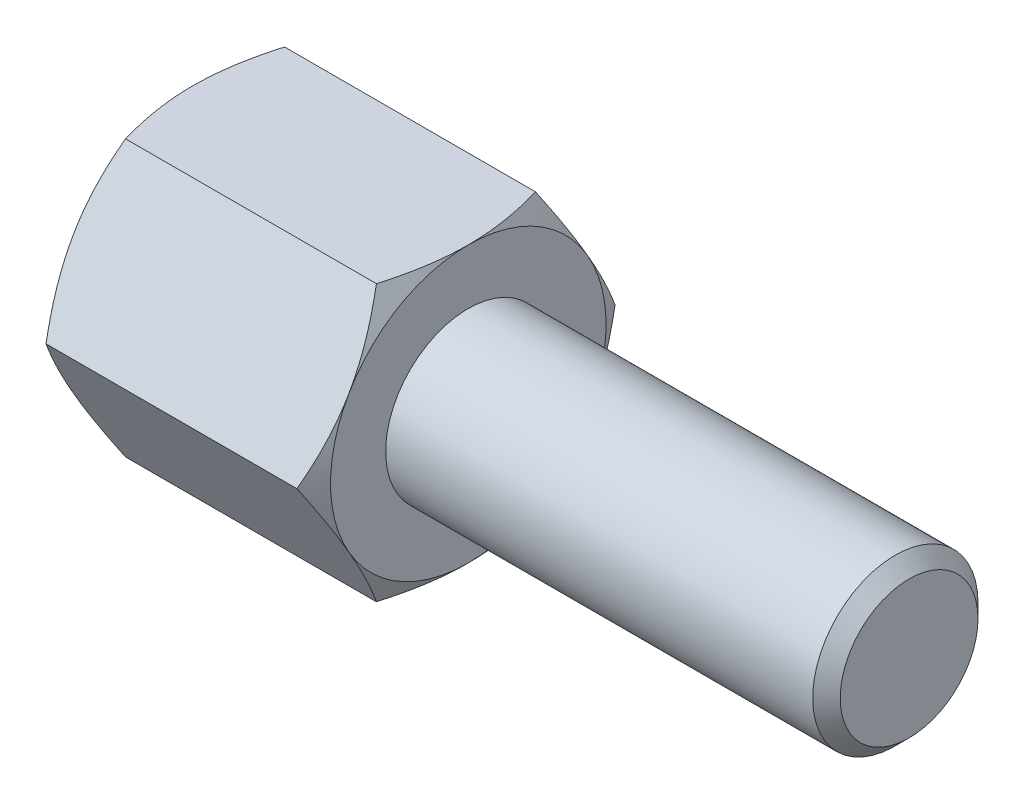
from build123d import *

# Parameters (mm, degrees)
EXTRUDE2_DEPTH = 2.5
SKETCH3_R      = 1.25
EXTRUDE3_DEPTH = 3
SKETCH5_R      = 1.5
EXTRUDE4_DEPTH = 8
CHAMFER1_SIZE  = 0.25


with BuildPart() as part:
    # Sketch1 → Extrude2 (new, symmetric)
    with BuildSketch(Plane(origin=(0, 0, 0), x_dir=(0, 0, -1), z_dir=(1, 0, 0))):
        Polygon((1.443375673, 2.5), (-1.443375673, 2.5), (-2.886751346, 0), (-1.443375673, -2.5), (1.443375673, -2.5), (2.886751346, 0), align=None)
    extrude(amount=EXTRUDE2_DEPTH, both=True)

    # Sketch2 → Cut-Revolve1 (revolve, cut)
    with BuildSketch(Plane.XY):
        with BuildLine():
            Line((-2.5, 2.5), (-1, 5.098076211))
            ThreePointArc((-1, 5.098076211), (-1.48810136, 6.276457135), (-2.5, 5.5))
            Line((-2.5, 5.5), (-2.5, 2.5))
        make_face()
    cut_revolve1 = revolve(axis=Axis((0, 0, 0), (1, 0, 0)), mode=Mode.SUBTRACT)

    # Mirror1: Cut-Revolve1 across plane
    add(cut_revolve1.mirror(Plane(origin=(0, 0, 0), x_dir=(0, 0, 1), z_dir=(1, 0, 0))), mode=Mode.SUBTRACT)

    # Sketch3 → Extrude3 (cut)
    with BuildSketch(Plane.ZY.offset(2.5)):
        Circle(SKETCH3_R)
    extrude(amount=-EXTRUDE3_DEPTH, mode=Mode.SUBTRACT)

    # Sketch4 → Cut-Revolve2 (revolve, cut)
    with BuildSketch(Plane.XY, mode=Mode.PRIVATE) as cut_revolve2_sk:
        Polygon((0.5, 0), (0.5, 1.25), (1.221687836, 0), align=None)
    revolve(cut_revolve2_sk.sketch.rotate(Axis((1.221687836, 0, 0), (-1, 0, 0)), 180), axis=Axis((1.221687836, 0, 0), (-1, 0, 0)), mode=Mode.SUBTRACT)

    # Sketch5 → Extrude4 (add)
    with BuildSketch(Plane(origin=(2.5, 0, 0), x_dir=(0, 0, -1), z_dir=(1, 0, 0))):
        Circle(SKETCH5_R)
    extrude(amount=EXTRUDE4_DEPTH)

    # Chamfer1
    chamfer1_edges = [part.edges().sort_by_distance(p)[0] for p in [
        (10.5, 0, 1.5),
    ]]
    chamfer(chamfer1_edges, length=CHAMFER1_SIZE)


solid = part.part
